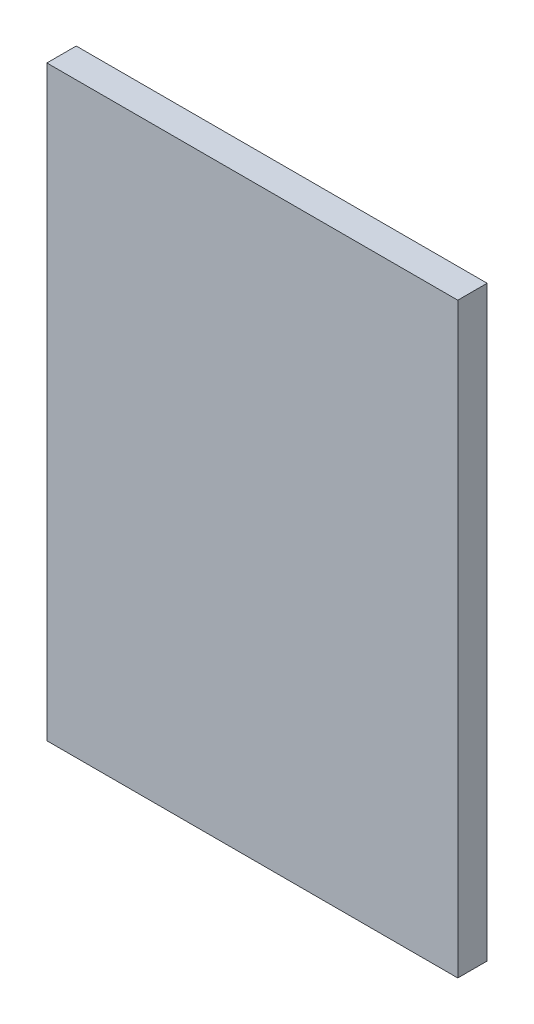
ISO-10303-21;
HEADER;
FILE_DESCRIPTION(('STEP AP214'),'2;1');
FILE_NAME('part.step','',(''),(''),'','','');
FILE_SCHEMA(('AUTOMOTIVE_DESIGN { 1 0 10303 214 1 1 1 1 }'));
ENDSEC;
DATA;
#1=APPLICATION_CONTEXT('core data for automotive mechanical design processes');
#2=APPLICATION_PROTOCOL_DEFINITION('international standard','automotive_design',2000,#1);
#3=PRODUCT_CONTEXT('',#1,'mechanical');
#4=PRODUCT('Part','Part','',(#3));
#5=PRODUCT_RELATED_PRODUCT_CATEGORY('part','',(#4));
#6=PRODUCT_DEFINITION_FORMATION('','',#4);
#7=PRODUCT_DEFINITION_CONTEXT('part definition',#1,'design');
#8=PRODUCT_DEFINITION('design','',#6,#7);
#9=PRODUCT_DEFINITION_SHAPE('','',#8);
#10=(LENGTH_UNIT() NAMED_UNIT(*) SI_UNIT(.MILLI.,.METRE.));
#11=(NAMED_UNIT(*) PLANE_ANGLE_UNIT() SI_UNIT($,.RADIAN.));
#12=(NAMED_UNIT(*) SI_UNIT($,.STERADIAN.) SOLID_ANGLE_UNIT());
#13=UNCERTAINTY_MEASURE_WITH_UNIT(LENGTH_MEASURE(1.E-05),#10,'distance_accuracy_value','');
#14=(GEOMETRIC_REPRESENTATION_CONTEXT(3) GLOBAL_UNCERTAINTY_ASSIGNED_CONTEXT((#13)) GLOBAL_UNIT_ASSIGNED_CONTEXT((#10,
#11,#12)) REPRESENTATION_CONTEXT('',''));
#15=CARTESIAN_POINT('',(0.,0.,0.));
#16=DIRECTION('',(0.,0.,1.));
#17=DIRECTION('',(1.,0.,0.));
#18=AXIS2_PLACEMENT_3D('',#15,#16,#17);
#19=CARTESIAN_POINT('',(-70.,0.,10.));
#20=DIRECTION('',(1.,0.,0.));
#21=DIRECTION('',(0.,0.,-1.));
#22=AXIS2_PLACEMENT_3D('',#19,#20,#21);
#23=PLANE('',#22);
#24=DIRECTION('',(0.,-1.,0.));
#25=VECTOR('',#24,1.);
#26=CARTESIAN_POINT('',(-70.,0.,0.));
#27=LINE('',#26,#25);
#28=CARTESIAN_POINT('',(-70.,200.,0.));
#29=VERTEX_POINT('',#28);
#30=CARTESIAN_POINT('',(-70.,0.,0.));
#31=VERTEX_POINT('',#30);
#32=EDGE_CURVE('E77',#29,#31,#27,.T.);
#33=ORIENTED_EDGE('',*,*,#32,.T.);
#34=DIRECTION('',(0.,0.,-1.));
#35=VECTOR('',#34,1.);
#36=CARTESIAN_POINT('',(-70.,0.,10.));
#37=LINE('',#36,#35);
#38=CARTESIAN_POINT('',(-70.,0.,10.));
#39=VERTEX_POINT('',#38);
#40=EDGE_CURVE('E11',#39,#31,#37,.T.);
#41=ORIENTED_EDGE('',*,*,#40,.F.);
#42=DIRECTION('',(0.,-1.,0.));
#43=VECTOR('',#42,1.);
#44=CARTESIAN_POINT('',(-70.,0.,10.));
#45=LINE('',#44,#43);
#46=CARTESIAN_POINT('',(-70.,200.,10.));
#47=VERTEX_POINT('',#46);
#48=EDGE_CURVE('E95',#47,#39,#45,.T.);
#49=ORIENTED_EDGE('',*,*,#48,.F.);
#50=DIRECTION('',(0.,0.,-1.));
#51=VECTOR('',#50,1.);
#52=CARTESIAN_POINT('',(-70.,200.,10.));
#53=LINE('',#52,#51);
#54=EDGE_CURVE('E89',#47,#29,#53,.T.);
#55=ORIENTED_EDGE('',*,*,#54,.T.);
#56=EDGE_LOOP('',(#33,#41,#49,#55));
#57=FACE_BOUND('',#56,.T.);
#58=ADVANCED_FACE('F33',(#57),#23,.F.);
#59=CARTESIAN_POINT('',(-70.,0.,10.));
#60=DIRECTION('',(0.,1.,0.));
#61=DIRECTION('',(0.,0.,1.));
#62=AXIS2_PLACEMENT_3D('',#59,#60,#61);
#63=PLANE('',#62);
#64=DIRECTION('',(1.,0.,0.));
#65=VECTOR('',#64,1.);
#66=CARTESIAN_POINT('',(-70.,0.,0.));
#67=LINE('',#66,#65);
#68=CARTESIAN_POINT('',(70.,0.,0.));
#69=VERTEX_POINT('',#68);
#70=EDGE_CURVE('E73',#31,#69,#67,.T.);
#71=ORIENTED_EDGE('',*,*,#70,.T.);
#72=DIRECTION('',(0.,0.,-1.));
#73=VECTOR('',#72,1.);
#74=CARTESIAN_POINT('',(70.,0.,10.));
#75=LINE('',#74,#73);
#76=CARTESIAN_POINT('',(70.,0.,10.));
#77=VERTEX_POINT('',#76);
#78=EDGE_CURVE('E40',#77,#69,#75,.T.);
#79=ORIENTED_EDGE('',*,*,#78,.F.);
#80=DIRECTION('',(1.,0.,0.));
#81=VECTOR('',#80,1.);
#82=CARTESIAN_POINT('',(-70.,0.,10.));
#83=LINE('',#82,#81);
#84=EDGE_CURVE('E85',#39,#77,#83,.T.);
#85=ORIENTED_EDGE('',*,*,#84,.F.);
#86=ORIENTED_EDGE('',*,*,#40,.T.);
#87=EDGE_LOOP('',(#71,#79,#85,#86));
#88=FACE_BOUND('',#87,.T.);
#89=ADVANCED_FACE('F84',(#88),#63,.F.);
#90=CARTESIAN_POINT('',(70.,0.,10.));
#91=DIRECTION('',(-1.,0.,0.));
#92=DIRECTION('',(0.,0.,1.));
#93=AXIS2_PLACEMENT_3D('',#90,#91,#92);
#94=PLANE('',#93);
#95=DIRECTION('',(0.,1.,0.));
#96=VECTOR('',#95,1.);
#97=CARTESIAN_POINT('',(70.,0.,0.));
#98=LINE('',#97,#96);
#99=CARTESIAN_POINT('',(70.,200.,0.));
#100=VERTEX_POINT('',#99);
#101=EDGE_CURVE('E78',#69,#100,#98,.T.);
#102=ORIENTED_EDGE('',*,*,#101,.T.);
#103=DIRECTION('',(0.,0.,-1.));
#104=VECTOR('',#103,1.);
#105=CARTESIAN_POINT('',(70.,200.,10.));
#106=LINE('',#105,#104);
#107=CARTESIAN_POINT('',(70.,200.,10.));
#108=VERTEX_POINT('',#107);
#109=EDGE_CURVE('E101',#108,#100,#106,.T.);
#110=ORIENTED_EDGE('',*,*,#109,.F.);
#111=DIRECTION('',(0.,1.,0.));
#112=VECTOR('',#111,1.);
#113=CARTESIAN_POINT('',(70.,0.,10.));
#114=LINE('',#113,#112);
#115=EDGE_CURVE('E52',#77,#108,#114,.T.);
#116=ORIENTED_EDGE('',*,*,#115,.F.);
#117=ORIENTED_EDGE('',*,*,#78,.T.);
#118=EDGE_LOOP('',(#102,#110,#116,#117));
#119=FACE_BOUND('',#118,.T.);
#120=ADVANCED_FACE('F104',(#119),#94,.F.);
#121=CARTESIAN_POINT('',(-70.,200.,10.));
#122=DIRECTION('',(0.,-1.,0.));
#123=DIRECTION('',(0.,0.,-1.));
#124=AXIS2_PLACEMENT_3D('',#121,#122,#123);
#125=PLANE('',#124);
#126=DIRECTION('',(-1.,0.,0.));
#127=VECTOR('',#126,1.);
#128=CARTESIAN_POINT('',(-70.,200.,0.));
#129=LINE('',#128,#127);
#130=EDGE_CURVE('E93',#100,#29,#129,.T.);
#131=ORIENTED_EDGE('',*,*,#130,.T.);
#132=ORIENTED_EDGE('',*,*,#54,.F.);
#133=DIRECTION('',(-1.,0.,0.));
#134=VECTOR('',#133,1.);
#135=CARTESIAN_POINT('',(-70.,200.,10.));
#136=LINE('',#135,#134);
#137=EDGE_CURVE('E47',#108,#47,#136,.T.);
#138=ORIENTED_EDGE('',*,*,#137,.F.);
#139=ORIENTED_EDGE('',*,*,#109,.T.);
#140=EDGE_LOOP('',(#131,#132,#138,#139));
#141=FACE_BOUND('',#140,.T.);
#142=ADVANCED_FACE('F106',(#141),#125,.F.);
#143=CARTESIAN_POINT('',(-70.,200.,10.));
#144=DIRECTION('',(0.,0.,-1.));
#145=DIRECTION('',(-1.,0.,0.));
#146=AXIS2_PLACEMENT_3D('',#143,#144,#145);
#147=PLANE('',#146);
#148=ORIENTED_EDGE('',*,*,#48,.T.);
#149=ORIENTED_EDGE('',*,*,#84,.T.);
#150=ORIENTED_EDGE('',*,*,#115,.T.);
#151=ORIENTED_EDGE('',*,*,#137,.T.);
#152=EDGE_LOOP('',(#148,#149,#150,#151));
#153=FACE_BOUND('',#152,.T.);
#154=ADVANCED_FACE('F107',(#153),#147,.F.);
#155=CARTESIAN_POINT('',(-70.,200.,0.));
#156=DIRECTION('',(0.,0.,-1.));
#157=DIRECTION('',(-1.,0.,0.));
#158=AXIS2_PLACEMENT_3D('',#155,#156,#157);
#159=PLANE('',#158);
#160=ORIENTED_EDGE('',*,*,#32,.F.);
#161=ORIENTED_EDGE('',*,*,#130,.F.);
#162=ORIENTED_EDGE('',*,*,#101,.F.);
#163=ORIENTED_EDGE('',*,*,#70,.F.);
#164=EDGE_LOOP('',(#160,#161,#162,#163));
#165=FACE_BOUND('',#164,.T.);
#166=ADVANCED_FACE('F74',(#165),#159,.T.);
#167=CLOSED_SHELL('',(#58,#89,#120,#142,#154,#166));
#168=MANIFOLD_SOLID_BREP('B2',#167);
#169=ADVANCED_BREP_SHAPE_REPRESENTATION('',(#18,#168),#14);
#170=SHAPE_DEFINITION_REPRESENTATION(#9,#169);
ENDSEC;
END-ISO-10303-21;
